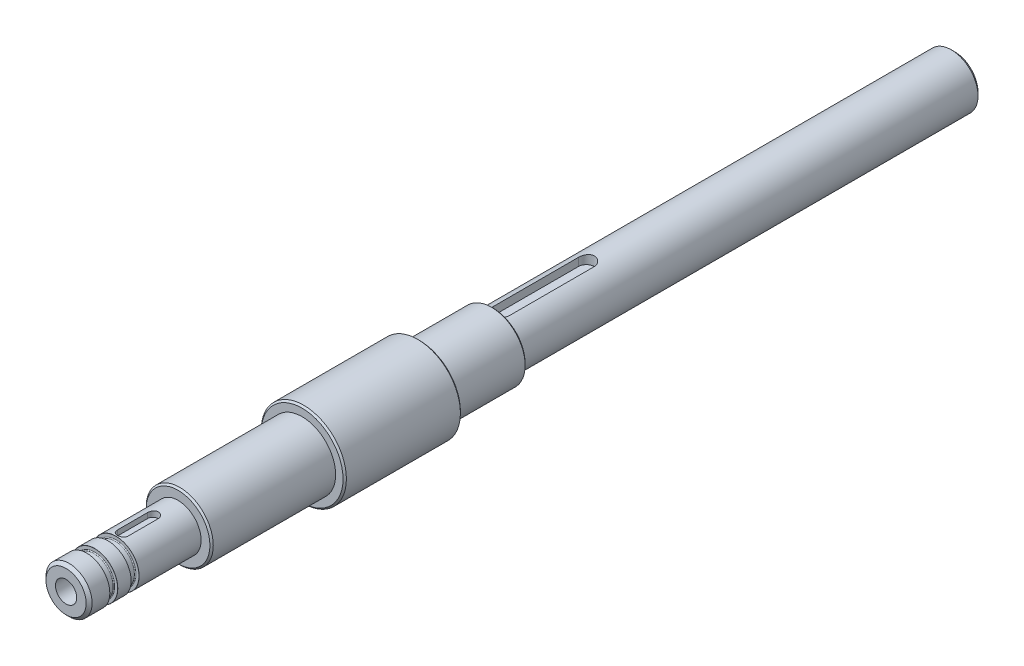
from build123d import *

# Parameters (mm, degrees)
BOSS_EXTRUDE1_DEPTH      = 150
BOSS_EXTRUDE1_DEPTH_BACK = 115
SKETCH1_R                = 12.7
SKETCH2_R                = 3.175
CUT_EXTRUDE1_DEPTH       = 266.607944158
SKETCH3_OUTSIDE_W        = 80.884
SKETCH3_OUTSIDE_H        = 80.884
SKETCH3_OUTSIDE_R        = 7
CUT_EXTRUDE2_DEPTH       = 70.39
SKETCH4_R                = 10
SKETCH4_R_2              = 6.35
BOSS_EXTRUDE2_DEPTH      = 37
SKETCH5_OUTSIDE_W        = 80.884
SKETCH5_OUTSIDE_H        = 80.884
SKETCH5_OUTSIDE_R        = 10
CUT_EXTRUDE3_DEPTH       = 161.617346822
SKETCH6_OUTSIDE_W        = 80.884
SKETCH6_OUTSIDE_H        = 80.884
SKETCH6_OUTSIDE_R        = 7.9375
CUT_EXTRUDE4_DEPTH       = 139.777131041
CHAMFER1_SIZE            = 1
CHAMFER2_SIZE            = 0.5
FILLET1_R                = 0.1778
SKETCH9_OUTSIDE_W        = 80.884
SKETCH9_OUTSIDE_H        = 80.884
SKETCH9_OUTSIDE_R        = 6.8834
CUT_EXTRUDE5_DEPTH       = 33.39
CUT_EXTRUDE6_DEPTH       = 2.74675
CUT_EXTRUDE7_DEPTH       = 1.75


with BuildPart() as part:
    # Sketch1 → Boss-Extrude1 (new, two sides: drawn at the far end of the back side and taken through both)
    with BuildSketch(Plane.XY.offset(-BOSS_EXTRUDE1_DEPTH_BACK)):
        Circle(SKETCH1_R)
    extrude(amount=BOSS_EXTRUDE1_DEPTH + BOSS_EXTRUDE1_DEPTH_BACK)

    # Sketch2 → Cut-Extrude1 (cut, through all)
    with BuildSketch(Plane.XY.offset(150)):
        Circle(SKETCH2_R)
    extrude(amount=-CUT_EXTRUDE1_DEPTH, mode=Mode.SUBTRACT)

    # Sketch3 outside → Cut-Extrude2 (cut)
    with BuildSketch(Plane.XY.offset(150)):
        Rectangle(SKETCH3_OUTSIDE_W, SKETCH3_OUTSIDE_H)
        Circle(SKETCH3_OUTSIDE_R, mode=Mode.SUBTRACT)
    extrude(amount=-CUT_EXTRUDE2_DEPTH, mode=Mode.SUBTRACT)

    # Sketch4 → Boss-Extrude2 (add)
    with BuildSketch(Plane.XY.offset(79.61)):
        Circle(SKETCH4_R)
        Circle(SKETCH4_R_2, mode=Mode.SUBTRACT)
    extrude(amount=BOSS_EXTRUDE2_DEPTH)

    # Sketch5 outside → Cut-Extrude3 (cut, through all)
    with BuildSketch(Plane.XY.offset(44.61)):
        Rectangle(SKETCH5_OUTSIDE_W, SKETCH5_OUTSIDE_H)
        Circle(SKETCH5_OUTSIDE_R, mode=Mode.SUBTRACT)
    extrude(amount=-CUT_EXTRUDE3_DEPTH, mode=Mode.SUBTRACT)

    # Sketch6 outside → Cut-Extrude4 (cut, through all)
    with BuildSketch(Plane.XY.offset(22.61)):
        Rectangle(SKETCH6_OUTSIDE_W, SKETCH6_OUTSIDE_H)
        Circle(SKETCH6_OUTSIDE_R, mode=Mode.SUBTRACT)
    extrude(amount=-CUT_EXTRUDE4_DEPTH, mode=Mode.SUBTRACT)

    # Chamfer1
    chamfer1_edges = [part.edges().sort_by_distance(p)[0] for p in [
        (-7, 0, 150),
        (-7.9375, 0, -115),
    ]]
    chamfer(chamfer1_edges, length=CHAMFER1_SIZE)

    # Chamfer2
    chamfer2_edges = [part.edges().sort_by_distance(p)[0] for p in [
        (-12.7, 0, 79.61),
        (-10, 0, 116.61),
        (-12.7, 0, 44.61),
        (-10, 0, 22.61),
    ]]
    chamfer(chamfer2_edges, length=CHAMFER2_SIZE)

    # Sketch8 → Cut-Revolve1 (revolve, cut)
    with BuildSketch(Plane(origin=(0, 0, 0), x_dir=(1, 0, 0), z_dir=(0, 1, 0)), mode=Mode.PRIVATE) as cut_revolve1_sk:
        with BuildLine():
            Line((5.9714, -141.4689), (8.2826, -141.4689))
            Line((8.2826, -141.4689), (8.2826, -143.8311))
            Line((8.2826, -143.8311), (5.9714, -143.8311))
            ThreePointArc((5.9714, -143.8311), (5.791794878, -143.756705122), (5.7174, -143.5771))
            Line((5.7174, -143.5771), (5.7174, -141.7229))
            ThreePointArc((5.7174, -141.7229), (5.791794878, -141.543294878), (5.9714, -141.4689))
        make_face()
        with BuildLine():
            Line((5.9714, -135.1189), (8.2826, -135.1189))
            Line((8.2826, -135.1189), (8.2826, -137.4811))
            Line((8.2826, -137.4811), (5.9714, -137.4811))
            ThreePointArc((5.9714, -137.4811), (5.791794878, -137.406705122), (5.7174, -137.2271))
            Line((5.7174, -137.2271), (5.7174, -135.3729))
            ThreePointArc((5.7174, -135.3729), (5.791794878, -135.193294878), (5.9714, -135.1189))
        make_face()
    revolve(cut_revolve1_sk.sketch.rotate(Axis((0, 0, -115), (0, 0, 1)), 180), axis=Axis((0, 0, -115), (0, 0, 1)), mode=Mode.SUBTRACT)

    # Fillet1
    fillet1_edges = [part.edges().sort_by_distance(p)[0] for p in [
        (-7, 0, 141.4689),
        (-7, 0, 143.8311),
        (-7, 0, 135.1189),
        (-7, 0, 137.4811),
    ]]
    fillet(fillet1_edges, radius=FILLET1_R)

    # Sketch9 outside → Cut-Extrude5 (cut)
    with BuildSketch(Plane.XY.offset(150)):
        Rectangle(SKETCH9_OUTSIDE_W, SKETCH9_OUTSIDE_H)
        Circle(SKETCH9_OUTSIDE_R, mode=Mode.SUBTRACT)
    extrude(amount=-CUT_EXTRUDE5_DEPTH, mode=Mode.SUBTRACT)

    # Sketch10 → Cut-Extrude6 (cut)
    with BuildSketch(Plane(origin=(0, 7.9375, 0), x_dir=(-1, 0, 0), z_dir=(0, 1, 0))):
        with BuildLine():
            Line((-2.38125, 20.22875), (-2.38125, -5.17125))
            ThreePointArc((-2.38125, -5.17125), (0, -7.5525), (2.38125, -5.17125))
            Line((2.38125, -5.17125), (2.38125, 20.22875))
            ThreePointArc((2.38125, 20.22875), (0, 22.61), (-2.38125, 20.22875))
        make_face()
    extrude(amount=-CUT_EXTRUDE6_DEPTH, mode=Mode.SUBTRACT)

    # Sketch11 → Cut-Extrude7 (cut)
    with BuildSketch(Plane(origin=(0, 6.8834, 0), x_dir=(-1, 0, 0), z_dir=(0, 1, 0))):
        with BuildLine():
            Line((-1.5875, 133.108035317), (-1.5875, 124.108035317))
            ThreePointArc((-1.5875, 124.108035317), (0, 122.520535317), (1.5875, 124.108035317))
            Line((1.5875, 124.108035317), (1.5875, 133.108035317))
            ThreePointArc((1.5875, 133.108035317), (0, 134.695535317), (-1.5875, 133.108035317))
        make_face()
    extrude(amount=-CUT_EXTRUDE7_DEPTH, mode=Mode.SUBTRACT)


solid = part.part
